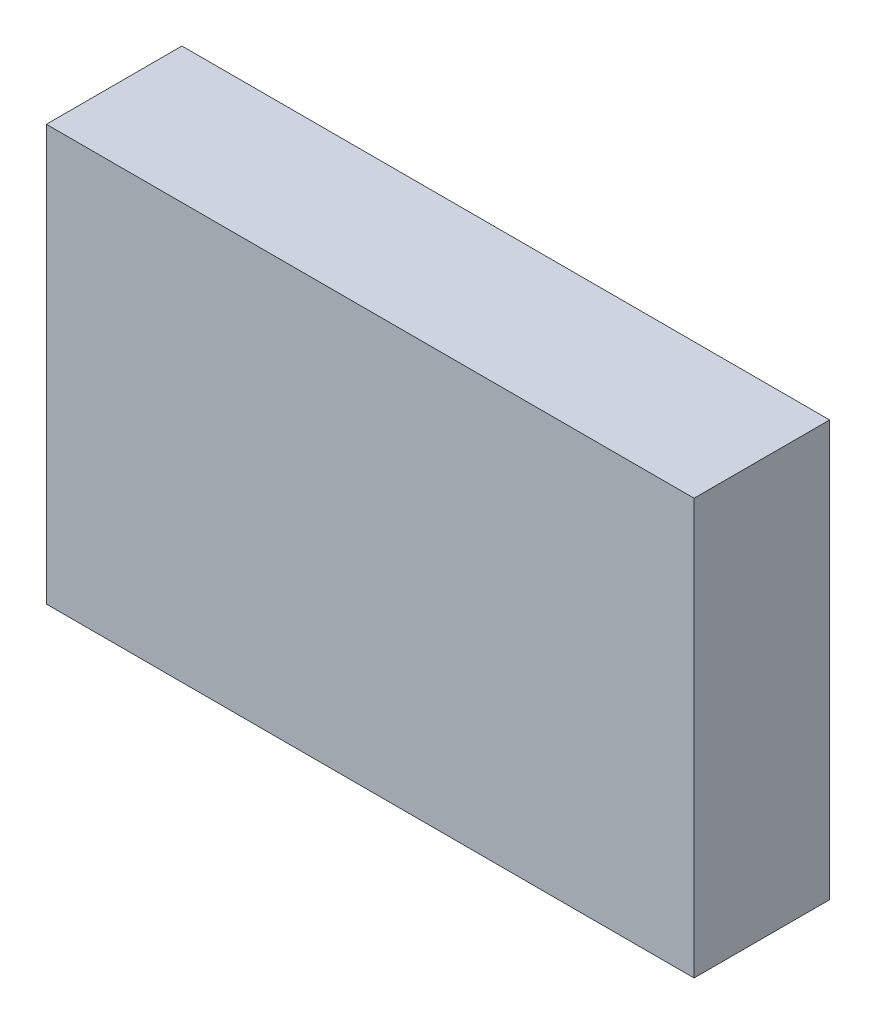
from build123d import *

# Parameters (mm, degrees)
SKETCH1_W           = 622.781
SKETCH1_H           = 970.788
BOSS_EXTRUDE1_DEPTH = 101.6


with BuildPart() as part:
    # Sketch1 → Boss-Extrude1 (new, symmetric)
    with BuildSketch(Plane(origin=(0, 0, 0), x_dir=(0, 1, 0), z_dir=(0, 0, 1))):
        Rectangle(SKETCH1_W, SKETCH1_H)
    extrude(amount=BOSS_EXTRUDE1_DEPTH, both=True)


solid = part.part
